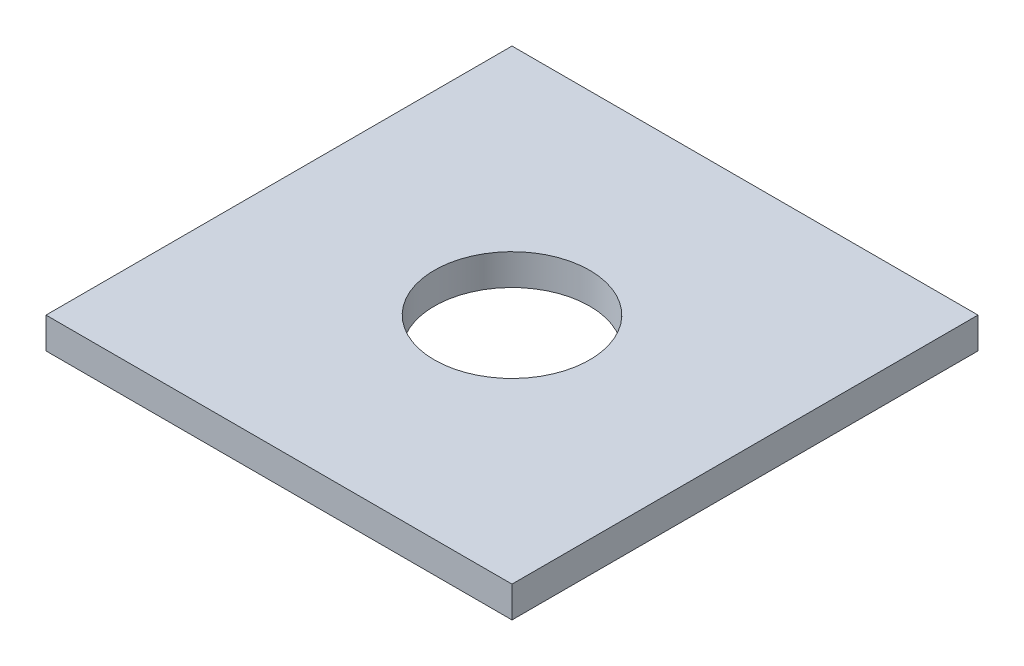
ISO-10303-21;
HEADER;
FILE_DESCRIPTION(('STEP AP214'),'2;1');
FILE_NAME('part.step','',(''),(''),'','','');
FILE_SCHEMA(('AUTOMOTIVE_DESIGN { 1 0 10303 214 1 1 1 1 }'));
ENDSEC;
DATA;
#1=APPLICATION_CONTEXT('core data for automotive mechanical design processes');
#2=APPLICATION_PROTOCOL_DEFINITION('international standard','automotive_design',2000,#1);
#3=PRODUCT_CONTEXT('',#1,'mechanical');
#4=PRODUCT('Part','Part','',(#3));
#5=PRODUCT_RELATED_PRODUCT_CATEGORY('part','',(#4));
#6=PRODUCT_DEFINITION_FORMATION('','',#4);
#7=PRODUCT_DEFINITION_CONTEXT('part definition',#1,'design');
#8=PRODUCT_DEFINITION('design','',#6,#7);
#9=PRODUCT_DEFINITION_SHAPE('','',#8);
#10=(LENGTH_UNIT() NAMED_UNIT(*) SI_UNIT(.MILLI.,.METRE.));
#11=(NAMED_UNIT(*) PLANE_ANGLE_UNIT() SI_UNIT($,.RADIAN.));
#12=(NAMED_UNIT(*) SI_UNIT($,.STERADIAN.) SOLID_ANGLE_UNIT());
#13=UNCERTAINTY_MEASURE_WITH_UNIT(LENGTH_MEASURE(1.E-05),#10,'distance_accuracy_value','');
#14=(GEOMETRIC_REPRESENTATION_CONTEXT(3) GLOBAL_UNCERTAINTY_ASSIGNED_CONTEXT((#13)) GLOBAL_UNIT_ASSIGNED_CONTEXT((#10,
#11,#12)) REPRESENTATION_CONTEXT('',''));
#15=CARTESIAN_POINT('',(0.,0.,0.));
#16=DIRECTION('',(0.,0.,1.));
#17=DIRECTION('',(1.,0.,0.));
#18=AXIS2_PLACEMENT_3D('',#15,#16,#17);
#19=CARTESIAN_POINT('',(45.,0.,45.));
#20=DIRECTION('',(0.,1.,0.));
#21=DIRECTION('',(0.,0.,1.));
#22=AXIS2_PLACEMENT_3D('',#19,#20,#21);
#23=PLANE('',#22);
#24=CARTESIAN_POINT('',(0.,0.,0.));
#25=DIRECTION('',(0.,1.,0.));
#26=DIRECTION('',(0.,0.,1.));
#27=AXIS2_PLACEMENT_3D('',#24,#25,#26);
#28=CIRCLE('',#27,15.);
#29=CARTESIAN_POINT('',(0.,0.,15.));
#30=VERTEX_POINT('',#29);
#31=EDGE_CURVE('E102',#30,#30,#28,.T.);
#32=ORIENTED_EDGE('',*,*,#31,.T.);
#33=EDGE_LOOP('',(#32));
#34=FACE_BOUND('',#33,.T.);
#35=DIRECTION('',(1.,0.,0.));
#36=VECTOR('',#35,1.);
#37=CARTESIAN_POINT('',(45.,0.,-45.));
#38=LINE('',#37,#36);
#39=CARTESIAN_POINT('',(-45.,0.,-45.));
#40=VERTEX_POINT('',#39);
#41=CARTESIAN_POINT('',(45.,0.,-45.));
#42=VERTEX_POINT('',#41);
#43=EDGE_CURVE('E105',#40,#42,#38,.T.);
#44=ORIENTED_EDGE('',*,*,#43,.T.);
#45=DIRECTION('',(0.,0.,-1.));
#46=VECTOR('',#45,1.);
#47=CARTESIAN_POINT('',(45.,0.,45.));
#48=LINE('',#47,#46);
#49=CARTESIAN_POINT('',(45.,0.,45.));
#50=VERTEX_POINT('',#49);
#51=EDGE_CURVE('E11',#50,#42,#48,.T.);
#52=ORIENTED_EDGE('',*,*,#51,.F.);
#53=DIRECTION('',(1.,0.,0.));
#54=VECTOR('',#53,1.);
#55=CARTESIAN_POINT('',(45.,0.,45.));
#56=LINE('',#55,#54);
#57=CARTESIAN_POINT('',(-45.,0.,45.));
#58=VERTEX_POINT('',#57);
#59=EDGE_CURVE('E86',#58,#50,#56,.T.);
#60=ORIENTED_EDGE('',*,*,#59,.F.);
#61=DIRECTION('',(0.,0.,-1.));
#62=VECTOR('',#61,1.);
#63=CARTESIAN_POINT('',(-45.,0.,45.));
#64=LINE('',#63,#62);
#65=EDGE_CURVE('E96',#58,#40,#64,.T.);
#66=ORIENTED_EDGE('',*,*,#65,.T.);
#67=EDGE_LOOP('',(#44,#52,#60,#66));
#68=FACE_BOUND('',#67,.T.);
#69=ADVANCED_FACE('F39',(#34,#68),#23,.F.);
#70=CARTESIAN_POINT('',(45.,6.,45.));
#71=DIRECTION('',(-1.,0.,0.));
#72=DIRECTION('',(0.,0.,1.));
#73=AXIS2_PLACEMENT_3D('',#70,#71,#72);
#74=PLANE('',#73);
#75=DIRECTION('',(0.,1.,0.));
#76=VECTOR('',#75,1.);
#77=CARTESIAN_POINT('',(45.,6.,-45.));
#78=LINE('',#77,#76);
#79=CARTESIAN_POINT('',(45.,6.,-45.));
#80=VERTEX_POINT('',#79);
#81=EDGE_CURVE('E91',#42,#80,#78,.T.);
#82=ORIENTED_EDGE('',*,*,#81,.T.);
#83=DIRECTION('',(0.,0.,-1.));
#84=VECTOR('',#83,1.);
#85=CARTESIAN_POINT('',(45.,6.,45.));
#86=LINE('',#85,#84);
#87=CARTESIAN_POINT('',(45.,6.,45.));
#88=VERTEX_POINT('',#87);
#89=EDGE_CURVE('E50',#88,#80,#86,.T.);
#90=ORIENTED_EDGE('',*,*,#89,.F.);
#91=DIRECTION('',(0.,1.,0.));
#92=VECTOR('',#91,1.);
#93=CARTESIAN_POINT('',(45.,6.,45.));
#94=LINE('',#93,#92);
#95=EDGE_CURVE('E82',#50,#88,#94,.T.);
#96=ORIENTED_EDGE('',*,*,#95,.F.);
#97=ORIENTED_EDGE('',*,*,#51,.T.);
#98=EDGE_LOOP('',(#82,#90,#96,#97));
#99=FACE_BOUND('',#98,.T.);
#100=ADVANCED_FACE('F94',(#99),#74,.F.);
#101=CARTESIAN_POINT('',(-45.,6.,45.));
#102=DIRECTION('',(0.,-1.,0.));
#103=DIRECTION('',(0.,0.,-1.));
#104=AXIS2_PLACEMENT_3D('',#101,#102,#103);
#105=PLANE('',#104);
#106=CARTESIAN_POINT('',(0.,6.,0.));
#107=DIRECTION('',(0.,1.,0.));
#108=DIRECTION('',(0.,0.,1.));
#109=AXIS2_PLACEMENT_3D('',#106,#107,#108);
#110=CIRCLE('',#109,15.);
#111=CARTESIAN_POINT('',(0.,6.,15.));
#112=VERTEX_POINT('',#111);
#113=EDGE_CURVE('E116',#112,#112,#110,.T.);
#114=ORIENTED_EDGE('',*,*,#113,.F.);
#115=EDGE_LOOP('',(#114));
#116=FACE_BOUND('',#115,.T.);
#117=DIRECTION('',(-1.,0.,0.));
#118=VECTOR('',#117,1.);
#119=CARTESIAN_POINT('',(-45.,6.,-45.));
#120=LINE('',#119,#118);
#121=CARTESIAN_POINT('',(-45.,6.,-45.));
#122=VERTEX_POINT('',#121);
#123=EDGE_CURVE('E75',#80,#122,#120,.T.);
#124=ORIENTED_EDGE('',*,*,#123,.T.);
#125=DIRECTION('',(0.,0.,-1.));
#126=VECTOR('',#125,1.);
#127=CARTESIAN_POINT('',(-45.,6.,45.));
#128=LINE('',#127,#126);
#129=CARTESIAN_POINT('',(-45.,6.,45.));
#130=VERTEX_POINT('',#129);
#131=EDGE_CURVE('E93',#130,#122,#128,.T.);
#132=ORIENTED_EDGE('',*,*,#131,.F.);
#133=DIRECTION('',(-1.,0.,0.));
#134=VECTOR('',#133,1.);
#135=CARTESIAN_POINT('',(-45.,6.,45.));
#136=LINE('',#135,#134);
#137=EDGE_CURVE('E88',#88,#130,#136,.T.);
#138=ORIENTED_EDGE('',*,*,#137,.F.);
#139=ORIENTED_EDGE('',*,*,#89,.T.);
#140=EDGE_LOOP('',(#124,#132,#138,#139));
#141=FACE_BOUND('',#140,.T.);
#142=ADVANCED_FACE('F98',(#116,#141),#105,.F.);
#143=CARTESIAN_POINT('',(-45.,0.,45.));
#144=DIRECTION('',(1.,0.,0.));
#145=DIRECTION('',(0.,0.,-1.));
#146=AXIS2_PLACEMENT_3D('',#143,#144,#145);
#147=PLANE('',#146);
#148=DIRECTION('',(0.,-1.,0.));
#149=VECTOR('',#148,1.);
#150=CARTESIAN_POINT('',(-45.,0.,-45.));
#151=LINE('',#150,#149);
#152=EDGE_CURVE('E76',#122,#40,#151,.T.);
#153=ORIENTED_EDGE('',*,*,#152,.T.);
#154=ORIENTED_EDGE('',*,*,#65,.F.);
#155=DIRECTION('',(0.,-1.,0.));
#156=VECTOR('',#155,1.);
#157=CARTESIAN_POINT('',(-45.,0.,45.));
#158=LINE('',#157,#156);
#159=EDGE_CURVE('E54',#130,#58,#158,.T.);
#160=ORIENTED_EDGE('',*,*,#159,.F.);
#161=ORIENTED_EDGE('',*,*,#131,.T.);
#162=EDGE_LOOP('',(#153,#154,#160,#161));
#163=FACE_BOUND('',#162,.T.);
#164=ADVANCED_FACE('F109',(#163),#147,.F.);
#165=CARTESIAN_POINT('',(-45.,0.,45.));
#166=DIRECTION('',(0.,0.,-1.));
#167=DIRECTION('',(-1.,0.,0.));
#168=AXIS2_PLACEMENT_3D('',#165,#166,#167);
#169=PLANE('',#168);
#170=ORIENTED_EDGE('',*,*,#59,.T.);
#171=ORIENTED_EDGE('',*,*,#95,.T.);
#172=ORIENTED_EDGE('',*,*,#137,.T.);
#173=ORIENTED_EDGE('',*,*,#159,.T.);
#174=EDGE_LOOP('',(#170,#171,#172,#173));
#175=FACE_BOUND('',#174,.T.);
#176=ADVANCED_FACE('F87',(#175),#169,.F.);
#177=CARTESIAN_POINT('',(-45.,0.,-45.));
#178=DIRECTION('',(0.,0.,-1.));
#179=DIRECTION('',(-1.,0.,0.));
#180=AXIS2_PLACEMENT_3D('',#177,#178,#179);
#181=PLANE('',#180);
#182=ORIENTED_EDGE('',*,*,#43,.F.);
#183=ORIENTED_EDGE('',*,*,#152,.F.);
#184=ORIENTED_EDGE('',*,*,#123,.F.);
#185=ORIENTED_EDGE('',*,*,#81,.F.);
#186=EDGE_LOOP('',(#182,#183,#184,#185));
#187=FACE_BOUND('',#186,.T.);
#188=ADVANCED_FACE('F113',(#187),#181,.T.);
#189=CARTESIAN_POINT('',(0.,0.,0.));
#190=DIRECTION('',(0.,1.,0.));
#191=DIRECTION('',(0.,0.,1.));
#192=AXIS2_PLACEMENT_3D('',#189,#190,#191);
#193=CYLINDRICAL_SURFACE('',#192,15.);
#194=ORIENTED_EDGE('',*,*,#31,.F.);
#195=EDGE_LOOP('',(#194));
#196=FACE_BOUND('',#195,.T.);
#197=ORIENTED_EDGE('',*,*,#113,.T.);
#198=EDGE_LOOP('',(#197));
#199=FACE_BOUND('',#198,.T.);
#200=ADVANCED_FACE('F124',(#196,#199),#193,.F.);
#201=CLOSED_SHELL('',(#69,#100,#142,#164,#176,#188,#200));
#202=MANIFOLD_SOLID_BREP('B2',#201);
#203=ADVANCED_BREP_SHAPE_REPRESENTATION('',(#18,#202),#14);
#204=SHAPE_DEFINITION_REPRESENTATION(#9,#203);
ENDSEC;
END-ISO-10303-21;
